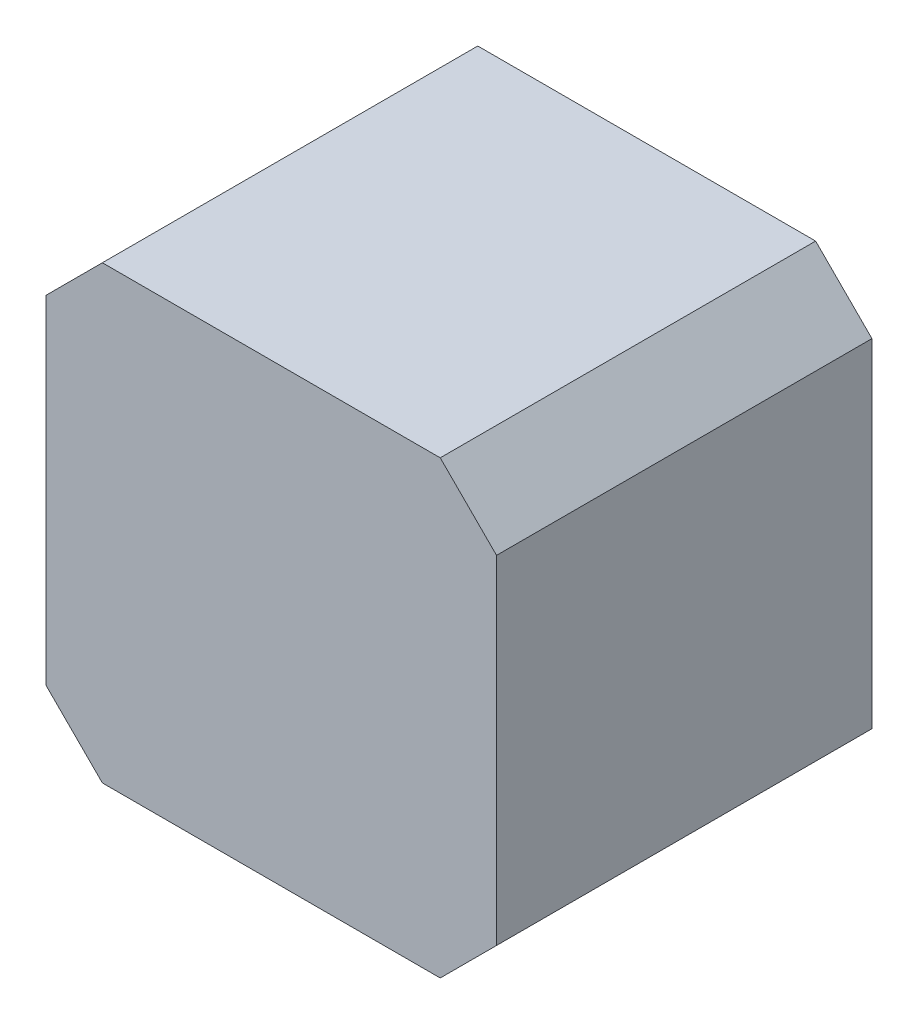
ISO-10303-21;
HEADER;
FILE_DESCRIPTION(('STEP AP214'),'2;1');
FILE_NAME('part.step','',(''),(''),'','','');
FILE_SCHEMA(('AUTOMOTIVE_DESIGN { 1 0 10303 214 1 1 1 1 }'));
ENDSEC;
DATA;
#1=APPLICATION_CONTEXT('core data for automotive mechanical design processes');
#2=APPLICATION_PROTOCOL_DEFINITION('international standard','automotive_design',2000,#1);
#3=PRODUCT_CONTEXT('',#1,'mechanical');
#4=PRODUCT('Part','Part','',(#3));
#5=PRODUCT_RELATED_PRODUCT_CATEGORY('part','',(#4));
#6=PRODUCT_DEFINITION_FORMATION('','',#4);
#7=PRODUCT_DEFINITION_CONTEXT('part definition',#1,'design');
#8=PRODUCT_DEFINITION('design','',#6,#7);
#9=PRODUCT_DEFINITION_SHAPE('','',#8);
#10=(LENGTH_UNIT() NAMED_UNIT(*) SI_UNIT(.MILLI.,.METRE.));
#11=(NAMED_UNIT(*) PLANE_ANGLE_UNIT() SI_UNIT($,.RADIAN.));
#12=(NAMED_UNIT(*) SI_UNIT($,.STERADIAN.) SOLID_ANGLE_UNIT());
#13=UNCERTAINTY_MEASURE_WITH_UNIT(LENGTH_MEASURE(1.E-05),#10,'distance_accuracy_value','');
#14=(GEOMETRIC_REPRESENTATION_CONTEXT(3) GLOBAL_UNCERTAINTY_ASSIGNED_CONTEXT((#13)) GLOBAL_UNIT_ASSIGNED_CONTEXT((#10,
#11,#12)) REPRESENTATION_CONTEXT('',''));
#15=CARTESIAN_POINT('',(0.,0.,0.));
#16=DIRECTION('',(0.,0.,1.));
#17=DIRECTION('',(1.,0.,0.));
#18=AXIS2_PLACEMENT_3D('',#15,#16,#17);
#19=CARTESIAN_POINT('',(0.,0.,5.));
#20=DIRECTION('',(-1.,0.,0.));
#21=DIRECTION('',(0.,-1.,0.));
#22=AXIS2_PLACEMENT_3D('',#19,#20,#21);
#23=PLANE('',#22);
#24=DIRECTION('',(0.,1.,0.));
#25=VECTOR('',#24,1.);
#26=CARTESIAN_POINT('',(0.,0.,-5.));
#27=LINE('',#26,#25);
#28=CARTESIAN_POINT('',(0.,1.5,-5.));
#29=VERTEX_POINT('',#28);
#30=CARTESIAN_POINT('',(0.,10.5,-5.));
#31=VERTEX_POINT('',#30);
#32=EDGE_CURVE('E127',#29,#31,#27,.T.);
#33=ORIENTED_EDGE('',*,*,#32,.T.);
#34=DIRECTION('',(0.,0.,1.));
#35=VECTOR('',#34,1.);
#36=CARTESIAN_POINT('',(0.,10.5,5.));
#37=LINE('',#36,#35);
#38=CARTESIAN_POINT('',(0.,10.5,5.));
#39=VERTEX_POINT('',#38);
#40=EDGE_CURVE('E105',#31,#39,#37,.T.);
#41=ORIENTED_EDGE('',*,*,#40,.T.);
#42=DIRECTION('',(0.,1.,0.));
#43=VECTOR('',#42,1.);
#44=CARTESIAN_POINT('',(0.,0.,5.));
#45=LINE('',#44,#43);
#46=CARTESIAN_POINT('',(0.,1.49999999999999,5.));
#47=VERTEX_POINT('',#46);
#48=EDGE_CURVE('E136',#47,#39,#45,.T.);
#49=ORIENTED_EDGE('',*,*,#48,.F.);
#50=DIRECTION('',(0.,0.,-1.));
#51=VECTOR('',#50,1.);
#52=CARTESIAN_POINT('',(0.,1.5,5.));
#53=LINE('',#52,#51);
#54=EDGE_CURVE('E110',#47,#29,#53,.T.);
#55=ORIENTED_EDGE('',*,*,#54,.T.);
#56=EDGE_LOOP('',(#33,#41,#49,#55));
#57=FACE_BOUND('',#56,.T.);
#58=ADVANCED_FACE('F34',(#57),#23,.F.);
#59=CARTESIAN_POINT('',(0.,12.,5.));
#60=DIRECTION('',(0.,-1.,0.));
#61=DIRECTION('',(1.,0.,0.));
#62=AXIS2_PLACEMENT_3D('',#59,#60,#61);
#63=PLANE('',#62);
#64=DIRECTION('',(-1.,0.,0.));
#65=VECTOR('',#64,1.);
#66=CARTESIAN_POINT('',(0.,12.,5.));
#67=LINE('',#66,#65);
#68=CARTESIAN_POINT('',(-1.5,12.,5.));
#69=VERTEX_POINT('',#68);
#70=CARTESIAN_POINT('',(-10.5,12.,5.));
#71=VERTEX_POINT('',#70);
#72=EDGE_CURVE('E120',#69,#71,#67,.T.);
#73=ORIENTED_EDGE('',*,*,#72,.F.);
#74=DIRECTION('',(0.,0.,-1.));
#75=VECTOR('',#74,1.);
#76=CARTESIAN_POINT('',(-1.5,12.,5.));
#77=LINE('',#76,#75);
#78=CARTESIAN_POINT('',(-1.5,12.,-5.));
#79=VERTEX_POINT('',#78);
#80=EDGE_CURVE('E104',#69,#79,#77,.T.);
#81=ORIENTED_EDGE('',*,*,#80,.T.);
#82=DIRECTION('',(-1.,0.,0.));
#83=VECTOR('',#82,1.);
#84=CARTESIAN_POINT('',(0.,12.,-5.));
#85=LINE('',#84,#83);
#86=CARTESIAN_POINT('',(-10.5,12.,-5.));
#87=VERTEX_POINT('',#86);
#88=EDGE_CURVE('E117',#79,#87,#85,.T.);
#89=ORIENTED_EDGE('',*,*,#88,.T.);
#90=DIRECTION('',(0.,0.,1.));
#91=VECTOR('',#90,1.);
#92=CARTESIAN_POINT('',(-10.5,12.,5.));
#93=LINE('',#92,#91);
#94=EDGE_CURVE('E122',#87,#71,#93,.T.);
#95=ORIENTED_EDGE('',*,*,#94,.T.);
#96=EDGE_LOOP('',(#73,#81,#89,#95));
#97=FACE_BOUND('',#96,.T.);
#98=ADVANCED_FACE('F116',(#97),#63,.F.);
#99=CARTESIAN_POINT('',(-12.,0.,5.));
#100=DIRECTION('',(1.,0.,0.));
#101=DIRECTION('',(0.,0.,-1.));
#102=AXIS2_PLACEMENT_3D('',#99,#100,#101);
#103=PLANE('',#102);
#104=DIRECTION('',(0.,-1.,0.));
#105=VECTOR('',#104,1.);
#106=CARTESIAN_POINT('',(-12.,0.,5.));
#107=LINE('',#106,#105);
#108=CARTESIAN_POINT('',(-12.,10.5,5.));
#109=VERTEX_POINT('',#108);
#110=CARTESIAN_POINT('',(-12.,1.5,5.));
#111=VERTEX_POINT('',#110);
#112=EDGE_CURVE('E162',#109,#111,#107,.T.);
#113=ORIENTED_EDGE('',*,*,#112,.F.);
#114=DIRECTION('',(0.,0.,-1.));
#115=VECTOR('',#114,1.);
#116=CARTESIAN_POINT('',(-12.,10.5,5.));
#117=LINE('',#116,#115);
#118=CARTESIAN_POINT('',(-12.,10.5,-5.));
#119=VERTEX_POINT('',#118);
#120=EDGE_CURVE('E155',#109,#119,#117,.T.);
#121=ORIENTED_EDGE('',*,*,#120,.T.);
#122=DIRECTION('',(0.,-1.,0.));
#123=VECTOR('',#122,1.);
#124=CARTESIAN_POINT('',(-12.,0.,-5.));
#125=LINE('',#124,#123);
#126=CARTESIAN_POINT('',(-12.,1.50000000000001,-5.));
#127=VERTEX_POINT('',#126);
#128=EDGE_CURVE('E126',#119,#127,#125,.T.);
#129=ORIENTED_EDGE('',*,*,#128,.T.);
#130=DIRECTION('',(0.,0.,1.));
#131=VECTOR('',#130,1.);
#132=CARTESIAN_POINT('',(-12.,1.50000000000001,5.));
#133=LINE('',#132,#131);
#134=EDGE_CURVE('E153',#127,#111,#133,.T.);
#135=ORIENTED_EDGE('',*,*,#134,.T.);
#136=EDGE_LOOP('',(#113,#121,#129,#135));
#137=FACE_BOUND('',#136,.T.);
#138=ADVANCED_FACE('F160',(#137),#103,.F.);
#139=CARTESIAN_POINT('',(0.,0.,5.));
#140=DIRECTION('',(0.,1.,0.));
#141=DIRECTION('',(-1.,0.,0.));
#142=AXIS2_PLACEMENT_3D('',#139,#140,#141);
#143=PLANE('',#142);
#144=DIRECTION('',(1.,0.,0.));
#145=VECTOR('',#144,1.);
#146=CARTESIAN_POINT('',(0.,0.,5.));
#147=LINE('',#146,#145);
#148=CARTESIAN_POINT('',(-10.5,0.,5.));
#149=VERTEX_POINT('',#148);
#150=CARTESIAN_POINT('',(-1.5,0.,5.));
#151=VERTEX_POINT('',#150);
#152=EDGE_CURVE('E137',#149,#151,#147,.T.);
#153=ORIENTED_EDGE('',*,*,#152,.F.);
#154=DIRECTION('',(0.,0.,-1.));
#155=VECTOR('',#154,1.);
#156=CARTESIAN_POINT('',(-10.5,0.,5.));
#157=LINE('',#156,#155);
#158=CARTESIAN_POINT('',(-10.5,0.,-5.));
#159=VERTEX_POINT('',#158);
#160=EDGE_CURVE('E11',#149,#159,#157,.T.);
#161=ORIENTED_EDGE('',*,*,#160,.T.);
#162=DIRECTION('',(1.,0.,0.));
#163=VECTOR('',#162,1.);
#164=CARTESIAN_POINT('',(0.,0.,-5.));
#165=LINE('',#164,#163);
#166=CARTESIAN_POINT('',(-1.5,0.,-5.));
#167=VERTEX_POINT('',#166);
#168=EDGE_CURVE('E130',#159,#167,#165,.T.);
#169=ORIENTED_EDGE('',*,*,#168,.T.);
#170=DIRECTION('',(0.,0.,1.));
#171=VECTOR('',#170,1.);
#172=CARTESIAN_POINT('',(-1.5,0.,5.));
#173=LINE('',#172,#171);
#174=EDGE_CURVE('E42',#167,#151,#173,.T.);
#175=ORIENTED_EDGE('',*,*,#174,.T.);
#176=EDGE_LOOP('',(#153,#161,#169,#175));
#177=FACE_BOUND('',#176,.T.);
#178=ADVANCED_FACE('F169',(#177),#143,.F.);
#179=CARTESIAN_POINT('',(0.,12.,5.));
#180=DIRECTION('',(0.,0.,1.));
#181=DIRECTION('',(1.,0.,0.));
#182=AXIS2_PLACEMENT_3D('',#179,#180,#181);
#183=PLANE('',#182);
#184=ORIENTED_EDGE('',*,*,#48,.T.);
#185=DIRECTION('',(0.707106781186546,-0.707106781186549,0.));
#186=VECTOR('',#185,1.);
#187=CARTESIAN_POINT('',(-0.750000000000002,11.25,5.));
#188=LINE('',#187,#186);
#189=EDGE_CURVE('E151',#39,#69,#188,.F.);
#190=ORIENTED_EDGE('',*,*,#189,.T.);
#191=ORIENTED_EDGE('',*,*,#72,.T.);
#192=DIRECTION('',(0.707106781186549,0.707106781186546,0.));
#193=VECTOR('',#192,1.);
#194=CARTESIAN_POINT('',(-5.24999999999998,17.25,5.));
#195=LINE('',#194,#193);
#196=EDGE_CURVE('E149',#71,#109,#195,.F.);
#197=ORIENTED_EDGE('',*,*,#196,.T.);
#198=ORIENTED_EDGE('',*,*,#112,.T.);
#199=DIRECTION('',(-0.707106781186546,0.707106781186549,0.));
#200=VECTOR('',#199,1.);
#201=CARTESIAN_POINT('',(-11.25,0.750000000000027,5.));
#202=LINE('',#201,#200);
#203=EDGE_CURVE('E55',#111,#149,#202,.F.);
#204=ORIENTED_EDGE('',*,*,#203,.T.);
#205=ORIENTED_EDGE('',*,*,#152,.T.);
#206=DIRECTION('',(-0.707106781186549,-0.707106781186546,0.));
#207=VECTOR('',#206,1.);
#208=CARTESIAN_POINT('',(5.25,6.74999999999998,5.));
#209=LINE('',#208,#207);
#210=EDGE_CURVE('E146',#151,#47,#209,.F.);
#211=ORIENTED_EDGE('',*,*,#210,.T.);
#212=EDGE_LOOP('',(#184,#190,#191,#197,#198,#204,#205,#211));
#213=FACE_BOUND('',#212,.T.);
#214=ADVANCED_FACE('F176',(#213),#183,.T.);
#215=CARTESIAN_POINT('',(0.,12.,-5.));
#216=DIRECTION('',(0.,0.,1.));
#217=DIRECTION('',(1.,0.,0.));
#218=AXIS2_PLACEMENT_3D('',#215,#216,#217);
#219=PLANE('',#218);
#220=ORIENTED_EDGE('',*,*,#88,.F.);
#221=DIRECTION('',(-0.707106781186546,0.707106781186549,0.));
#222=VECTOR('',#221,1.);
#223=CARTESIAN_POINT('',(-1.5,12.,-5.));
#224=LINE('',#223,#222);
#225=EDGE_CURVE('E100',#79,#31,#224,.F.);
#226=ORIENTED_EDGE('',*,*,#225,.T.);
#227=ORIENTED_EDGE('',*,*,#32,.F.);
#228=DIRECTION('',(0.707106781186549,0.707106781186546,0.));
#229=VECTOR('',#228,1.);
#230=CARTESIAN_POINT('',(0.,1.5,-5.));
#231=LINE('',#230,#229);
#232=EDGE_CURVE('E121',#29,#167,#231,.F.);
#233=ORIENTED_EDGE('',*,*,#232,.T.);
#234=ORIENTED_EDGE('',*,*,#168,.F.);
#235=DIRECTION('',(0.707106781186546,-0.707106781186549,0.));
#236=VECTOR('',#235,1.);
#237=CARTESIAN_POINT('',(-10.5,0.,-5.));
#238=LINE('',#237,#236);
#239=EDGE_CURVE('E140',#159,#127,#238,.F.);
#240=ORIENTED_EDGE('',*,*,#239,.T.);
#241=ORIENTED_EDGE('',*,*,#128,.F.);
#242=DIRECTION('',(-0.707106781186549,-0.707106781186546,0.));
#243=VECTOR('',#242,1.);
#244=CARTESIAN_POINT('',(-12.,10.5,-5.));
#245=LINE('',#244,#243);
#246=EDGE_CURVE('E111',#119,#87,#245,.F.);
#247=ORIENTED_EDGE('',*,*,#246,.T.);
#248=EDGE_LOOP('',(#220,#226,#227,#233,#234,#240,#241,#247));
#249=FACE_BOUND('',#248,.T.);
#250=ADVANCED_FACE('F124',(#249),#219,.F.);
#251=CARTESIAN_POINT('',(-1.5,12.,5.));
#252=DIRECTION('',(-0.707106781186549,-0.707106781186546,0.));
#253=DIRECTION('',(0.707106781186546,-0.707106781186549,0.));
#254=AXIS2_PLACEMENT_3D('',#251,#252,#253);
#255=PLANE('',#254);
#256=ORIENTED_EDGE('',*,*,#189,.F.);
#257=ORIENTED_EDGE('',*,*,#40,.F.);
#258=ORIENTED_EDGE('',*,*,#225,.F.);
#259=ORIENTED_EDGE('',*,*,#80,.F.);
#260=EDGE_LOOP('',(#256,#257,#258,#259));
#261=FACE_BOUND('',#260,.T.);
#262=ADVANCED_FACE('F103',(#261),#255,.F.);
#263=CARTESIAN_POINT('',(-12.,10.5,5.));
#264=DIRECTION('',(0.707106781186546,-0.707106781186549,0.));
#265=DIRECTION('',(0.707106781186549,0.707106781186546,0.));
#266=AXIS2_PLACEMENT_3D('',#263,#264,#265);
#267=PLANE('',#266);
#268=ORIENTED_EDGE('',*,*,#196,.F.);
#269=ORIENTED_EDGE('',*,*,#94,.F.);
#270=ORIENTED_EDGE('',*,*,#246,.F.);
#271=ORIENTED_EDGE('',*,*,#120,.F.);
#272=EDGE_LOOP('',(#268,#269,#270,#271));
#273=FACE_BOUND('',#272,.T.);
#274=ADVANCED_FACE('F184',(#273),#267,.F.);
#275=CARTESIAN_POINT('',(-10.5,0.,5.));
#276=DIRECTION('',(0.707106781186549,0.707106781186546,0.));
#277=DIRECTION('',(-0.707106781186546,0.707106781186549,0.));
#278=AXIS2_PLACEMENT_3D('',#275,#276,#277);
#279=PLANE('',#278);
#280=ORIENTED_EDGE('',*,*,#203,.F.);
#281=ORIENTED_EDGE('',*,*,#134,.F.);
#282=ORIENTED_EDGE('',*,*,#239,.F.);
#283=ORIENTED_EDGE('',*,*,#160,.F.);
#284=EDGE_LOOP('',(#280,#281,#282,#283));
#285=FACE_BOUND('',#284,.T.);
#286=ADVANCED_FACE('F168',(#285),#279,.F.);
#287=CARTESIAN_POINT('',(0.,1.5,5.));
#288=DIRECTION('',(-0.707106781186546,0.707106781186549,0.));
#289=DIRECTION('',(-0.707106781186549,-0.707106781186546,0.));
#290=AXIS2_PLACEMENT_3D('',#287,#288,#289);
#291=PLANE('',#290);
#292=ORIENTED_EDGE('',*,*,#210,.F.);
#293=ORIENTED_EDGE('',*,*,#174,.F.);
#294=ORIENTED_EDGE('',*,*,#232,.F.);
#295=ORIENTED_EDGE('',*,*,#54,.F.);
#296=EDGE_LOOP('',(#292,#293,#294,#295));
#297=FACE_BOUND('',#296,.T.);
#298=ADVANCED_FACE('F36',(#297),#291,.F.);
#299=CLOSED_SHELL('',(#58,#98,#138,#178,#214,#250,#262,#274,#286,#298));
#300=MANIFOLD_SOLID_BREP('B2',#299);
#301=ADVANCED_BREP_SHAPE_REPRESENTATION('',(#18,#300),#14);
#302=SHAPE_DEFINITION_REPRESENTATION(#9,#301);
ENDSEC;
END-ISO-10303-21;
